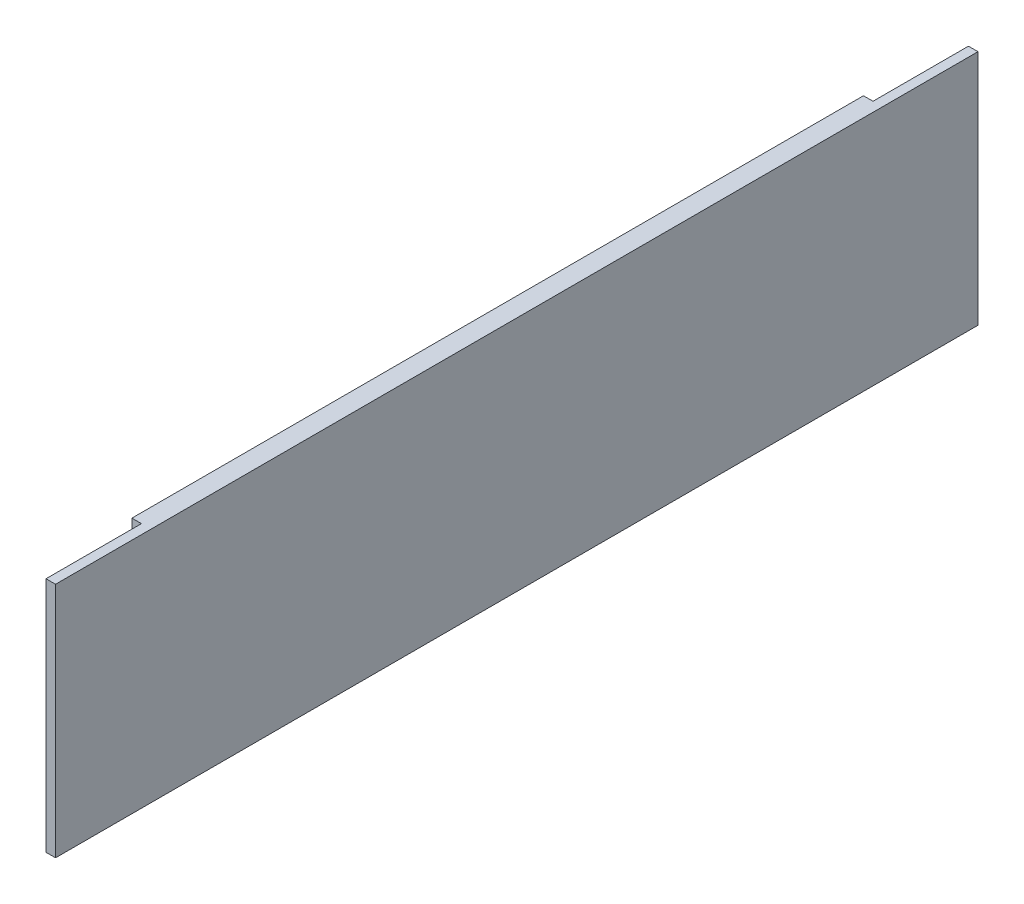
ISO-10303-21;
HEADER;
FILE_DESCRIPTION(('STEP AP214'),'2;1');
FILE_NAME('part.step','',(''),(''),'','','');
FILE_SCHEMA(('AUTOMOTIVE_DESIGN { 1 0 10303 214 1 1 1 1 }'));
ENDSEC;
DATA;
#1=APPLICATION_CONTEXT('core data for automotive mechanical design processes');
#2=APPLICATION_PROTOCOL_DEFINITION('international standard','automotive_design',2000,#1);
#3=PRODUCT_CONTEXT('',#1,'mechanical');
#4=PRODUCT('Part','Part','',(#3));
#5=PRODUCT_RELATED_PRODUCT_CATEGORY('part','',(#4));
#6=PRODUCT_DEFINITION_FORMATION('','',#4);
#7=PRODUCT_DEFINITION_CONTEXT('part definition',#1,'design');
#8=PRODUCT_DEFINITION('design','',#6,#7);
#9=PRODUCT_DEFINITION_SHAPE('','',#8);
#10=(LENGTH_UNIT() NAMED_UNIT(*) SI_UNIT(.MILLI.,.METRE.));
#11=(NAMED_UNIT(*) PLANE_ANGLE_UNIT() SI_UNIT($,.RADIAN.));
#12=(NAMED_UNIT(*) SI_UNIT($,.STERADIAN.) SOLID_ANGLE_UNIT());
#13=UNCERTAINTY_MEASURE_WITH_UNIT(LENGTH_MEASURE(1.E-05),#10,'distance_accuracy_value','');
#14=(GEOMETRIC_REPRESENTATION_CONTEXT(3) GLOBAL_UNCERTAINTY_ASSIGNED_CONTEXT((#13)) GLOBAL_UNIT_ASSIGNED_CONTEXT((#10,
#11,#12)) REPRESENTATION_CONTEXT('',''));
#15=CARTESIAN_POINT('',(0.,0.,0.));
#16=DIRECTION('',(0.,0.,1.));
#17=DIRECTION('',(1.,0.,0.));
#18=AXIS2_PLACEMENT_3D('',#15,#16,#17);
#19=CARTESIAN_POINT('',(-119.30239365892,432.532912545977,2110.00000000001));
#20=DIRECTION('',(1.,0.,0.));
#21=DIRECTION('',(0.,0.,-1.));
#22=AXIS2_PLACEMENT_3D('',#19,#20,#21);
#23=PLANE('',#22);
#24=DIRECTION('',(0.,-1.,0.));
#25=VECTOR('',#24,1.);
#26=CARTESIAN_POINT('',(-119.30239365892,372.536960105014,1850.00000000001));
#27=LINE('',#26,#25);
#28=CARTESIAN_POINT('',(-119.30239365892,142.51739571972,1850.00000000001));
#29=VERTEX_POINT('',#28);
#30=CARTESIAN_POINT('',(-119.30239365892,83.0246653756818,1850.00000000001));
#31=VERTEX_POINT('',#30);
#32=EDGE_CURVE('E138',#29,#31,#27,.T.);
#33=ORIENTED_EDGE('',*,*,#32,.F.);
#34=DIRECTION('',(0.,0.,-1.));
#35=VECTOR('',#34,1.);
#36=CARTESIAN_POINT('',(-119.30239365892,142.51739571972,2110.00000000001));
#37=LINE('',#36,#35);
#38=CARTESIAN_POINT('',(-119.30239365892,142.51739571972,1820.00000000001));
#39=VERTEX_POINT('',#38);
#40=EDGE_CURVE('E64',#29,#39,#37,.T.);
#41=ORIENTED_EDGE('',*,*,#40,.T.);
#42=DIRECTION('',(0.,-1.,0.));
#43=VECTOR('',#42,1.);
#44=CARTESIAN_POINT('',(-119.30239365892,432.532912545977,1820.00000000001));
#45=LINE('',#44,#43);
#46=CARTESIAN_POINT('',(-119.30239365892,68.0246653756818,1820.00000000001));
#47=VERTEX_POINT('',#46);
#48=EDGE_CURVE('E163',#39,#47,#45,.T.);
#49=ORIENTED_EDGE('',*,*,#48,.T.);
#50=DIRECTION('',(0.,0.,1.));
#51=VECTOR('',#50,1.);
#52=CARTESIAN_POINT('',(-119.30239365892,68.0246653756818,2110.00000000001));
#53=LINE('',#52,#51);
#54=CARTESIAN_POINT('',(-119.30239365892,68.0246653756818,2110.00000000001));
#55=VERTEX_POINT('',#54);
#56=EDGE_CURVE('E153',#47,#55,#53,.T.);
#57=ORIENTED_EDGE('',*,*,#56,.T.);
#58=DIRECTION('',(0.,-1.,0.));
#59=VECTOR('',#58,1.);
#60=CARTESIAN_POINT('',(-119.30239365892,432.532912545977,2110.00000000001));
#61=LINE('',#60,#59);
#62=CARTESIAN_POINT('',(-119.30239365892,142.51739571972,2110.00000000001));
#63=VERTEX_POINT('',#62);
#64=EDGE_CURVE('E161',#63,#55,#61,.T.);
#65=ORIENTED_EDGE('',*,*,#64,.F.);
#66=CARTESIAN_POINT('',(-119.30239365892,142.51739571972,2080.00000000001));
#67=VERTEX_POINT('',#66);
#68=EDGE_CURVE('E142',#63,#67,#37,.T.);
#69=ORIENTED_EDGE('',*,*,#68,.T.);
#70=DIRECTION('',(0.,-1.,0.));
#71=VECTOR('',#70,1.);
#72=CARTESIAN_POINT('',(-119.30239365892,372.536960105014,2080.00000000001));
#73=LINE('',#72,#71);
#74=CARTESIAN_POINT('',(-119.30239365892,83.0246653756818,2080.00000000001));
#75=VERTEX_POINT('',#74);
#76=EDGE_CURVE('E119',#67,#75,#73,.T.);
#77=ORIENTED_EDGE('',*,*,#76,.T.);
#78=DIRECTION('',(0.,0.,-1.));
#79=VECTOR('',#78,1.);
#80=CARTESIAN_POINT('',(-119.30239365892,83.0246653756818,1850.00000000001));
#81=LINE('',#80,#79);
#82=EDGE_CURVE('E124',#75,#31,#81,.T.);
#83=ORIENTED_EDGE('',*,*,#82,.T.);
#84=EDGE_LOOP('',(#33,#41,#49,#57,#65,#69,#77,#83));
#85=FACE_BOUND('',#84,.T.);
#86=ADVANCED_FACE('F39',(#85),#23,.F.);
#87=CARTESIAN_POINT('',(0.,68.0246653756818,0.));
#88=DIRECTION('',(0.,1.,0.));
#89=DIRECTION('',(0.,0.,1.));
#90=AXIS2_PLACEMENT_3D('',#87,#88,#89);
#91=PLANE('',#90);
#92=DIRECTION('',(0.,0.,-1.));
#93=VECTOR('',#92,1.);
#94=CARTESIAN_POINT('',(-116.30239365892,68.0246653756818,2110.00000000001));
#95=LINE('',#94,#93);
#96=CARTESIAN_POINT('',(-116.30239365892,68.0246653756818,2110.00000000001));
#97=VERTEX_POINT('',#96);
#98=CARTESIAN_POINT('',(-116.30239365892,68.0246653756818,1820.00000000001));
#99=VERTEX_POINT('',#98);
#100=EDGE_CURVE('E147',#97,#99,#95,.T.);
#101=ORIENTED_EDGE('',*,*,#100,.F.);
#102=DIRECTION('',(1.,0.,0.));
#103=VECTOR('',#102,1.);
#104=CARTESIAN_POINT('',(-116.30239365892,68.0246653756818,2110.00000000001));
#105=LINE('',#104,#103);
#106=EDGE_CURVE('E156',#55,#97,#105,.T.);
#107=ORIENTED_EDGE('',*,*,#106,.F.);
#108=ORIENTED_EDGE('',*,*,#56,.F.);
#109=DIRECTION('',(-1.,0.,0.));
#110=VECTOR('',#109,1.);
#111=CARTESIAN_POINT('',(-116.30239365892,68.0246653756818,1820.00000000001));
#112=LINE('',#111,#110);
#113=EDGE_CURVE('E150',#99,#47,#112,.T.);
#114=ORIENTED_EDGE('',*,*,#113,.F.);
#115=EDGE_LOOP('',(#101,#107,#108,#114));
#116=FACE_BOUND('',#115,.T.);
#117=ADVANCED_FACE('F184',(#116),#91,.F.);
#118=CARTESIAN_POINT('',(-116.30239365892,432.532912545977,2110.00000000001));
#119=DIRECTION('',(0.,0.,-1.));
#120=DIRECTION('',(0.,1.,0.));
#121=AXIS2_PLACEMENT_3D('',#118,#119,#120);
#122=PLANE('',#121);
#123=DIRECTION('',(0.,-1.,0.));
#124=VECTOR('',#123,1.);
#125=CARTESIAN_POINT('',(-116.30239365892,432.532912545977,2110.00000000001));
#126=LINE('',#125,#124);
#127=CARTESIAN_POINT('',(-116.30239365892,142.51739571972,2110.00000000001));
#128=VERTEX_POINT('',#127);
#129=EDGE_CURVE('E159',#128,#97,#126,.T.);
#130=ORIENTED_EDGE('',*,*,#129,.F.);
#131=DIRECTION('',(-1.,0.,0.));
#132=VECTOR('',#131,1.);
#133=CARTESIAN_POINT('',(-116.30239365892,142.51739571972,2110.00000000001));
#134=LINE('',#133,#132);
#135=EDGE_CURVE('E43',#128,#63,#134,.T.);
#136=ORIENTED_EDGE('',*,*,#135,.T.);
#137=ORIENTED_EDGE('',*,*,#64,.T.);
#138=ORIENTED_EDGE('',*,*,#106,.T.);
#139=EDGE_LOOP('',(#130,#136,#137,#138));
#140=FACE_BOUND('',#139,.T.);
#141=ADVANCED_FACE('F171',(#140),#122,.F.);
#142=CARTESIAN_POINT('',(-116.30239365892,432.532912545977,1820.00000000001));
#143=DIRECTION('',(0.,0.,1.));
#144=DIRECTION('',(0.,-1.,0.));
#145=AXIS2_PLACEMENT_3D('',#142,#143,#144);
#146=PLANE('',#145);
#147=ORIENTED_EDGE('',*,*,#48,.F.);
#148=DIRECTION('',(1.,0.,0.));
#149=VECTOR('',#148,1.);
#150=CARTESIAN_POINT('',(-116.30239365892,142.51739571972,1820.00000000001));
#151=LINE('',#150,#149);
#152=CARTESIAN_POINT('',(-116.30239365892,142.51739571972,1820.00000000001));
#153=VERTEX_POINT('',#152);
#154=EDGE_CURVE('E48',#39,#153,#151,.T.);
#155=ORIENTED_EDGE('',*,*,#154,.T.);
#156=DIRECTION('',(0.,-1.,0.));
#157=VECTOR('',#156,1.);
#158=CARTESIAN_POINT('',(-116.30239365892,432.532912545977,1820.00000000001));
#159=LINE('',#158,#157);
#160=EDGE_CURVE('E164',#153,#99,#159,.T.);
#161=ORIENTED_EDGE('',*,*,#160,.T.);
#162=ORIENTED_EDGE('',*,*,#113,.T.);
#163=EDGE_LOOP('',(#147,#155,#161,#162));
#164=FACE_BOUND('',#163,.T.);
#165=ADVANCED_FACE('F178',(#164),#146,.F.);
#166=CARTESIAN_POINT('',(-116.30239365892,432.532912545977,2110.00000000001));
#167=DIRECTION('',(-1.,0.,0.));
#168=DIRECTION('',(0.,0.,1.));
#169=AXIS2_PLACEMENT_3D('',#166,#167,#168);
#170=PLANE('',#169);
#171=ORIENTED_EDGE('',*,*,#160,.F.);
#172=DIRECTION('',(0.,0.,1.));
#173=VECTOR('',#172,1.);
#174=CARTESIAN_POINT('',(-116.30239365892,142.51739571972,2110.00000000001));
#175=LINE('',#174,#173);
#176=EDGE_CURVE('E11',#153,#128,#175,.T.);
#177=ORIENTED_EDGE('',*,*,#176,.T.);
#178=ORIENTED_EDGE('',*,*,#129,.T.);
#179=ORIENTED_EDGE('',*,*,#100,.T.);
#180=EDGE_LOOP('',(#171,#177,#178,#179));
#181=FACE_BOUND('',#180,.T.);
#182=ADVANCED_FACE('F41',(#181),#170,.F.);
#183=CARTESIAN_POINT('',(-122.30239365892,142.51739571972,2132.37812893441));
#184=DIRECTION('',(0.,-1.,0.));
#185=DIRECTION('',(0.,0.,-1.));
#186=AXIS2_PLACEMENT_3D('',#183,#184,#185);
#187=PLANE('',#186);
#188=ORIENTED_EDGE('',*,*,#154,.F.);
#189=ORIENTED_EDGE('',*,*,#40,.F.);
#190=DIRECTION('',(1.,0.,0.));
#191=VECTOR('',#190,1.);
#192=CARTESIAN_POINT('',(-122.30239365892,142.51739571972,1850.00000000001));
#193=LINE('',#192,#191);
#194=CARTESIAN_POINT('',(-122.30239365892,142.51739571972,1850.00000000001));
#195=VERTEX_POINT('',#194);
#196=EDGE_CURVE('E118',#195,#29,#193,.T.);
#197=ORIENTED_EDGE('',*,*,#196,.F.);
#198=DIRECTION('',(0.,0.,-1.));
#199=VECTOR('',#198,1.);
#200=CARTESIAN_POINT('',(-122.30239365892,142.51739571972,1850.00000000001));
#201=LINE('',#200,#199);
#202=CARTESIAN_POINT('',(-122.30239365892,142.51739571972,2080.00000000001));
#203=VERTEX_POINT('',#202);
#204=EDGE_CURVE('E132',#203,#195,#201,.T.);
#205=ORIENTED_EDGE('',*,*,#204,.F.);
#206=DIRECTION('',(-1.,0.,0.));
#207=VECTOR('',#206,1.);
#208=CARTESIAN_POINT('',(-122.30239365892,142.51739571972,2080.00000000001));
#209=LINE('',#208,#207);
#210=EDGE_CURVE('E114',#67,#203,#209,.T.);
#211=ORIENTED_EDGE('',*,*,#210,.F.);
#212=ORIENTED_EDGE('',*,*,#68,.F.);
#213=ORIENTED_EDGE('',*,*,#135,.F.);
#214=ORIENTED_EDGE('',*,*,#176,.F.);
#215=EDGE_LOOP('',(#188,#189,#197,#205,#211,#212,#213,#214));
#216=FACE_BOUND('',#215,.T.);
#217=ADVANCED_FACE('F174',(#216),#187,.F.);
#218=CARTESIAN_POINT('',(0.,83.0246653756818,0.));
#219=DIRECTION('',(0.,1.,0.));
#220=DIRECTION('',(0.,0.,1.));
#221=AXIS2_PLACEMENT_3D('',#218,#219,#220);
#222=PLANE('',#221);
#223=DIRECTION('',(0.,0.,1.));
#224=VECTOR('',#223,1.);
#225=CARTESIAN_POINT('',(-122.30239365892,83.0246653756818,1850.00000000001));
#226=LINE('',#225,#224);
#227=CARTESIAN_POINT('',(-122.30239365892,83.0246653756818,1850.00000000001));
#228=VERTEX_POINT('',#227);
#229=CARTESIAN_POINT('',(-122.30239365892,83.0246653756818,2080.00000000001));
#230=VERTEX_POINT('',#229);
#231=EDGE_CURVE('E122',#228,#230,#226,.T.);
#232=ORIENTED_EDGE('',*,*,#231,.F.);
#233=DIRECTION('',(-1.,0.,0.));
#234=VECTOR('',#233,1.);
#235=CARTESIAN_POINT('',(-122.30239365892,83.0246653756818,1850.00000000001));
#236=LINE('',#235,#234);
#237=EDGE_CURVE('E56',#31,#228,#236,.T.);
#238=ORIENTED_EDGE('',*,*,#237,.F.);
#239=ORIENTED_EDGE('',*,*,#82,.F.);
#240=DIRECTION('',(1.,0.,0.));
#241=VECTOR('',#240,1.);
#242=CARTESIAN_POINT('',(-122.30239365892,83.0246653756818,2080.00000000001));
#243=LINE('',#242,#241);
#244=EDGE_CURVE('E113',#230,#75,#243,.T.);
#245=ORIENTED_EDGE('',*,*,#244,.F.);
#246=EDGE_LOOP('',(#232,#238,#239,#245));
#247=FACE_BOUND('',#246,.T.);
#248=ADVANCED_FACE('F121',(#247),#222,.F.);
#249=CARTESIAN_POINT('',(-122.30239365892,372.536960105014,1850.00000000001));
#250=DIRECTION('',(0.,0.,1.));
#251=DIRECTION('',(1.,0.,0.));
#252=AXIS2_PLACEMENT_3D('',#249,#250,#251);
#253=PLANE('',#252);
#254=DIRECTION('',(0.,-1.,0.));
#255=VECTOR('',#254,1.);
#256=CARTESIAN_POINT('',(-122.30239365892,372.536960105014,1850.00000000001));
#257=LINE('',#256,#255);
#258=EDGE_CURVE('E129',#195,#228,#257,.T.);
#259=ORIENTED_EDGE('',*,*,#258,.F.);
#260=ORIENTED_EDGE('',*,*,#196,.T.);
#261=ORIENTED_EDGE('',*,*,#32,.T.);
#262=ORIENTED_EDGE('',*,*,#237,.T.);
#263=EDGE_LOOP('',(#259,#260,#261,#262));
#264=FACE_BOUND('',#263,.T.);
#265=ADVANCED_FACE('F180',(#264),#253,.F.);
#266=CARTESIAN_POINT('',(-122.30239365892,372.536960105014,2080.00000000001));
#267=DIRECTION('',(0.,0.,-1.));
#268=DIRECTION('',(-1.,0.,0.));
#269=AXIS2_PLACEMENT_3D('',#266,#267,#268);
#270=PLANE('',#269);
#271=ORIENTED_EDGE('',*,*,#76,.F.);
#272=ORIENTED_EDGE('',*,*,#210,.T.);
#273=DIRECTION('',(0.,-1.,0.));
#274=VECTOR('',#273,1.);
#275=CARTESIAN_POINT('',(-122.30239365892,372.536960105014,2080.00000000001));
#276=LINE('',#275,#274);
#277=EDGE_CURVE('E109',#203,#230,#276,.T.);
#278=ORIENTED_EDGE('',*,*,#277,.T.);
#279=ORIENTED_EDGE('',*,*,#244,.T.);
#280=EDGE_LOOP('',(#271,#272,#278,#279));
#281=FACE_BOUND('',#280,.T.);
#282=ADVANCED_FACE('F112',(#281),#270,.F.);
#283=CARTESIAN_POINT('',(-122.30239365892,372.536960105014,1850.00000000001));
#284=DIRECTION('',(1.,0.,0.));
#285=DIRECTION('',(0.,0.,-1.));
#286=AXIS2_PLACEMENT_3D('',#283,#284,#285);
#287=PLANE('',#286);
#288=ORIENTED_EDGE('',*,*,#277,.F.);
#289=ORIENTED_EDGE('',*,*,#204,.T.);
#290=ORIENTED_EDGE('',*,*,#258,.T.);
#291=ORIENTED_EDGE('',*,*,#231,.T.);
#292=EDGE_LOOP('',(#288,#289,#290,#291));
#293=FACE_BOUND('',#292,.T.);
#294=ADVANCED_FACE('F127',(#293),#287,.F.);
#295=CLOSED_SHELL('',(#86,#117,#141,#165,#182,#217,#248,#265,#282,#294));
#296=MANIFOLD_SOLID_BREP('B2',#295);
#297=ADVANCED_BREP_SHAPE_REPRESENTATION('',(#18,#296),#14);
#298=SHAPE_DEFINITION_REPRESENTATION(#9,#297);
ENDSEC;
END-ISO-10303-21;
